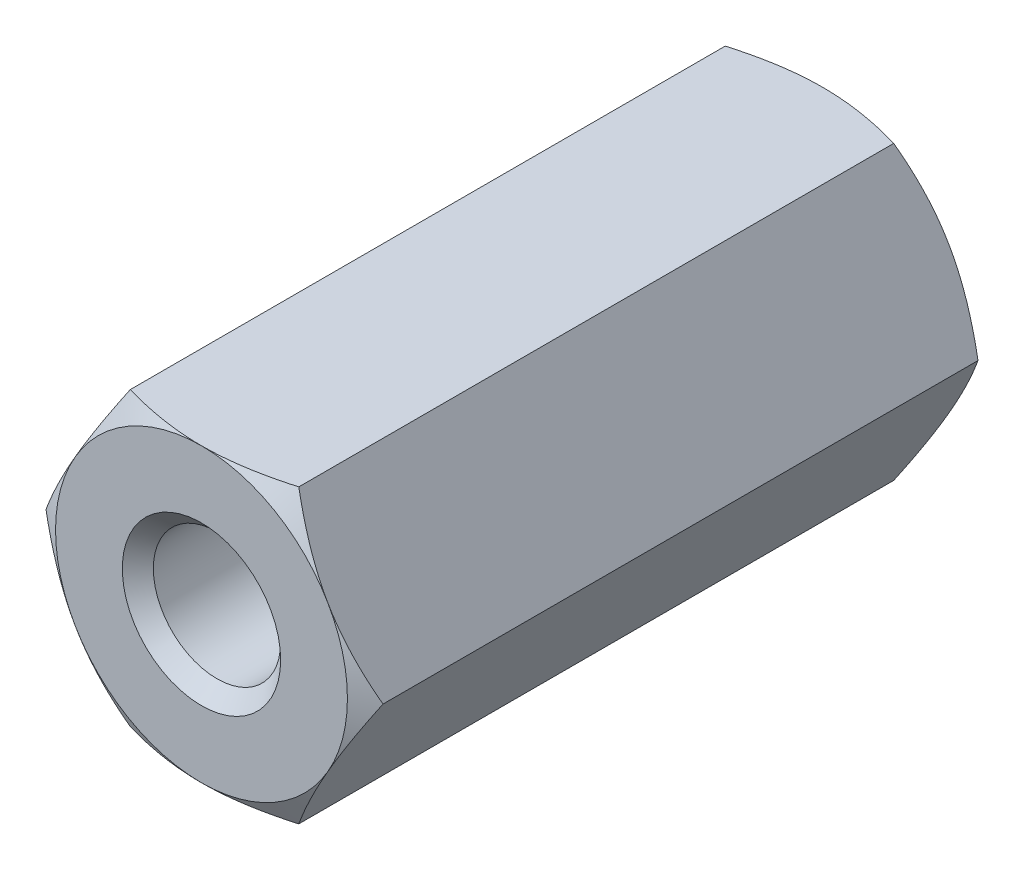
ISO-10303-21;
HEADER;
FILE_DESCRIPTION(('STEP AP214'),'2;1');
FILE_NAME('part.step','',(''),(''),'','','');
FILE_SCHEMA(('AUTOMOTIVE_DESIGN { 1 0 10303 214 1 1 1 1 }'));
ENDSEC;
DATA;
#1=APPLICATION_CONTEXT('core data for automotive mechanical design processes');
#2=APPLICATION_PROTOCOL_DEFINITION('international standard','automotive_design',2000,#1);
#3=PRODUCT_CONTEXT('',#1,'mechanical');
#4=PRODUCT('Part','Part','',(#3));
#5=PRODUCT_RELATED_PRODUCT_CATEGORY('part','',(#4));
#6=PRODUCT_DEFINITION_FORMATION('','',#4);
#7=PRODUCT_DEFINITION_CONTEXT('part definition',#1,'design');
#8=PRODUCT_DEFINITION('design','',#6,#7);
#9=PRODUCT_DEFINITION_SHAPE('','',#8);
#10=(LENGTH_UNIT() NAMED_UNIT(*) SI_UNIT(.MILLI.,.METRE.));
#11=(NAMED_UNIT(*) PLANE_ANGLE_UNIT() SI_UNIT($,.RADIAN.));
#12=(NAMED_UNIT(*) SI_UNIT($,.STERADIAN.) SOLID_ANGLE_UNIT());
#13=UNCERTAINTY_MEASURE_WITH_UNIT(LENGTH_MEASURE(1.E-05),#10,'distance_accuracy_value','');
#14=(GEOMETRIC_REPRESENTATION_CONTEXT(3) GLOBAL_UNCERTAINTY_ASSIGNED_CONTEXT((#13)) GLOBAL_UNIT_ASSIGNED_CONTEXT((#10,
#11,#12)) REPRESENTATION_CONTEXT('',''));
#15=CARTESIAN_POINT('',(0.,0.,0.));
#16=DIRECTION('',(0.,0.,1.));
#17=DIRECTION('',(1.,0.,0.));
#18=AXIS2_PLACEMENT_3D('',#15,#16,#17);
#19=CARTESIAN_POINT('',(0.,0.,-6.));
#20=DIRECTION('',(0.,0.,1.));
#21=DIRECTION('',(1.,0.,0.));
#22=AXIS2_PLACEMENT_3D('',#19,#20,#21);
#23=CONICAL_SURFACE('',#22,2.35,1.0471975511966);
#24=CARTESIAN_POINT('',(0.,-2.35,-6.));
#25=CARTESIAN_POINT('',(-0.0571314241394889,-2.34998207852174,-6.00002004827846));
#26=CARTESIAN_POINT('',(-0.114262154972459,-2.34994530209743,-5.99882905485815));
#27=CARTESIAN_POINT('',(-0.228234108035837,-2.34989200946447,-5.9940693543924));
#28=CARTESIAN_POINT('',(-0.285075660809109,-2.34987542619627,-5.9905085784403));
#29=CARTESIAN_POINT('',(-0.399044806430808,-2.34991978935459,-5.98101315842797));
#30=CARTESIAN_POINT('',(-0.456170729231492,-2.34998139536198,-5.97505861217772));
#31=CARTESIAN_POINT('',(-0.571263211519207,-2.35009640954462,-5.96081772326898));
#32=CARTESIAN_POINT('',(-0.629224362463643,-2.35014963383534,-5.95248805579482));
#33=CARTESIAN_POINT('',(-0.74206182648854,-2.35015725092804,-5.93420461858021));
#34=CARTESIAN_POINT('',(-0.796953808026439,-2.35011622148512,-5.92434687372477));
#35=CARTESIAN_POINT('',(-0.907157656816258,-2.35005079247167,-5.90270409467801));
#36=CARTESIAN_POINT('',(-0.962464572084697,-2.35002663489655,-5.89089390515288));
#37=CARTESIAN_POINT('',(-1.07381088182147,-2.34999732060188,-5.86536521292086));
#38=CARTESIAN_POINT('',(-1.12984248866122,-2.34999255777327,-5.8516129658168));
#39=CARTESIAN_POINT('',(-1.2429173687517,-2.34999209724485,-5.82220504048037));
#40=CARTESIAN_POINT('',(-1.29995044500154,-2.34999663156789,-5.80651005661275));
#41=CARTESIAN_POINT('',(-1.35677313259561,-2.34999999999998,-5.79010646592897));
#42=B_SPLINE_CURVE_WITH_KNOTS('',3,(#24,#25,#26,#27,#28,#29,#30,#31,#32,#33,#34,#35,#36,#37,#38,
#39,#40,#41),.UNSPECIFIED.,.F.,.F.,(4,2,2,2,2,2,2,2,4),(0.,0.171380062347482,0.342189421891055,
0.514449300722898,0.690078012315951,0.85735809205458,1.02699077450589,1.20005187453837,
1.37748447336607),.UNSPECIFIED.);
#43=CARTESIAN_POINT('',(0.,-2.35,-6.));
#44=VERTEX_POINT('',#43);
#45=CARTESIAN_POINT('',(-1.35677313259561,-2.35,-5.79010646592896));
#46=VERTEX_POINT('',#45);
#47=EDGE_CURVE('E797',#44,#46,#42,.T.);
#48=ORIENTED_EDGE('',*,*,#47,.T.);
#49=CARTESIAN_POINT('',(-1.35677313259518,-2.34999999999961,-5.79010646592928));
#50=CARTESIAN_POINT('',(-1.38524931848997,-2.30067108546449,-5.80654916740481));
#51=CARTESIAN_POINT('',(-1.41383092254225,-2.25115878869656,-5.82227951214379));
#52=CARTESIAN_POINT('',(-1.4705077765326,-2.15299689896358,-5.85174948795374));
#53=CARTESIAN_POINT('',(-1.49859769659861,-2.10435604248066,-5.86552856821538));
#54=CARTESIAN_POINT('',(-1.55443746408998,-2.00770249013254,-5.89110218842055));
#55=CARTESIAN_POINT('',(-1.58218307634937,-1.95969635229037,-5.90293053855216));
#56=CARTESIAN_POINT('',(-1.63748446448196,-1.86404217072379,-5.9246014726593));
#57=CARTESIAN_POINT('',(-1.66503759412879,-1.81639829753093,-5.93446915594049));
#58=CARTESIAN_POINT('',(-1.72144578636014,-1.71867419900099,-5.95271303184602));
#59=CARTESIAN_POINT('',(-1.75030427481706,-1.66857982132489,-5.96100341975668));
#60=CARTESIAN_POINT('',(-1.80760488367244,-1.56909917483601,-5.97517708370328));
#61=CARTESIAN_POINT('',(-1.83604445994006,-1.5197176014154,-5.98110321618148));
#62=CARTESIAN_POINT('',(-1.89285266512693,-1.42123457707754,-5.99055360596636));
#63=CARTESIAN_POINT('',(-1.92121990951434,-1.37213422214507,-5.9940974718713));
#64=CARTESIAN_POINT('',(-1.97811651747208,-1.2736927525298,-5.99883459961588));
#65=CARTESIAN_POINT('',(-2.00664610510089,-1.22435138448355,-6.00001988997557));
#66=CARTESIAN_POINT('',(-2.03515969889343,-1.17500000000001,-6.));
#67=B_SPLINE_CURVE_WITH_KNOTS('',3,(#49,#50,#51,#52,#53,#54,#55,#56,#57,#58,#59,#60,#61,#62,#63,
#64,#65,#66),.UNSPECIFIED.,.F.,.F.,(4,2,2,2,2,2,2,2,4),(0.,0.177855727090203,0.351336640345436,
0.521392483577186,0.689106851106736,0.864276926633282,1.03610921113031,1.20650922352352,
1.37748417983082),.UNSPECIFIED.);
#68=CARTESIAN_POINT('',(-2.03515969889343,-1.175,-6.));
#69=VERTEX_POINT('',#68);
#70=EDGE_CURVE('E386',#46,#69,#67,.T.);
#71=ORIENTED_EDGE('',*,*,#70,.T.);
#72=CARTESIAN_POINT('',(0.,0.,-6.));
#73=DIRECTION('',(0.,0.,1.));
#74=DIRECTION('',(1.,0.,0.));
#75=AXIS2_PLACEMENT_3D('',#72,#73,#74);
#76=CIRCLE('',#75,2.35);
#77=EDGE_CURVE('E413',#69,#44,#76,.T.);
#78=ORIENTED_EDGE('',*,*,#77,.T.);
#79=EDGE_LOOP('',(#48,#71,#78));
#80=FACE_BOUND('',#79,.T.);
#81=ADVANCED_FACE('F16',(#80),#23,.T.);
#82=CARTESIAN_POINT('',(0.,0.,-6.));
#83=DIRECTION('',(0.,0.,1.));
#84=DIRECTION('',(1.,0.,0.));
#85=AXIS2_PLACEMENT_3D('',#82,#83,#84);
#86=CONICAL_SURFACE('',#85,2.35,1.0471975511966);
#87=CARTESIAN_POINT('',(2.03515969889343,-1.17499999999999,-6.));
#88=CARTESIAN_POINT('',(2.00667423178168,-1.22430268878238,-6.0000198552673));
#89=CARTESIAN_POINT('',(1.97817723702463,-1.27359778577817,-5.99883401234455));
#90=CARTESIAN_POINT('',(1.92133687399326,-1.37197127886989,-5.99409676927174));
#91=CARTESIAN_POINT('',(1.8929933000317,-1.421049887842,-5.99055227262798));
#92=CARTESIAN_POINT('',(1.83621888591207,-1.51951127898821,-5.98110151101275));
#93=CARTESIAN_POINT('',(1.80778949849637,-1.56889290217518,-5.97517459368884));
#94=CARTESIAN_POINT('',(1.75048990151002,-1.66839238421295,-5.96100078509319));
#95=CARTESIAN_POINT('',(1.72162215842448,-1.71850537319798,-5.95271013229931));
#96=CARTESIAN_POINT('',(1.66518009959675,-1.81627678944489,-5.93446572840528));
#97=CARTESIAN_POINT('',(1.6376026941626,-1.8639494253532,-5.92459709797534));
#98=CARTESIAN_POINT('',(1.58225836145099,-1.95964970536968,-5.90292450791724));
#99=CARTESIAN_POINT('',(1.55449402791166,-2.00767324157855,-5.89109584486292));
#100=CARTESIAN_POINT('',(1.49862389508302,-2.10435071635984,-5.86552245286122));
#101=CARTESIAN_POINT('',(1.47052229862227,-2.15299817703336,-5.85174427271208));
#102=CARTESIAN_POINT('',(1.41383174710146,-2.25116352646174,-5.82227696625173));
#103=CARTESIAN_POINT('',(1.38524815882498,-2.30067279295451,-5.80654869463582));
#104=CARTESIAN_POINT('',(1.35677313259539,-2.34999999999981,-5.79010646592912));
#105=B_SPLINE_CURVE_WITH_KNOTS('',3,(#87,#88,#89,#90,#91,#92,#93,#94,#95,#96,#97,#98,#99,#100,
#101,#102,#103,#104),.UNSPECIFIED.,.F.,.F.,(4,2,2,2,2,2,2,2,4),(0.,0.170806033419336,
0.341114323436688,0.512931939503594,0.688163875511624,0.855988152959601,1.02611582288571,
1.19962971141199,1.37747903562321),.UNSPECIFIED.);
#106=CARTESIAN_POINT('',(2.03515969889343,-1.175,-6.));
#107=VERTEX_POINT('',#106);
#108=CARTESIAN_POINT('',(1.35677313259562,-2.35,-5.79010646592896));
#109=VERTEX_POINT('',#108);
#110=EDGE_CURVE('E474',#107,#109,#105,.T.);
#111=ORIENTED_EDGE('',*,*,#110,.T.);
#112=CARTESIAN_POINT('',(1.35677313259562,-2.34999999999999,-5.79010646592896));
#113=CARTESIAN_POINT('',(1.29993976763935,-2.34999669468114,-5.8065131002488));
#114=CARTESIAN_POINT('',(1.24289600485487,-2.34999167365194,-5.82221112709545));
#115=CARTESIAN_POINT('',(1.12980076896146,-2.34999037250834,-5.85162463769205));
#116=CARTESIAN_POINT('',(1.07375950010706,-2.34999387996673,-5.86537945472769));
#117=CARTESIAN_POINT('',(0.962394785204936,-2.35002021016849,-5.89091269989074));
#118=CARTESIAN_POINT('',(0.907079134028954,-2.35004264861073,-5.90272490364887));
#119=CARTESIAN_POINT('',(0.796858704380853,-2.35010348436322,-5.92437156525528));
#120=CARTESIAN_POINT('',(0.741958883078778,-2.35014165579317,-5.93423120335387));
#121=CARTESIAN_POINT('',(0.62913761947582,-2.35013023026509,-5.95251152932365));
#122=CARTESIAN_POINT('',(0.571200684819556,-2.35007621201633,-5.96083727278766));
#123=CARTESIAN_POINT('',(0.456146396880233,-2.34996316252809,-5.97507144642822));
#124=CARTESIAN_POINT('',(0.399034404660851,-2.34990424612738,-5.98102282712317));
#125=CARTESIAN_POINT('',(0.285083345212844,-2.34986570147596,-5.99051357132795));
#126=CARTESIAN_POINT('',(0.228245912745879,-2.3498854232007,-5.99407242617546));
#127=CARTESIAN_POINT('',(0.114272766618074,-2.34994357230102,-5.99882983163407));
#128=CARTESIAN_POINT('',(0.0571367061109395,-2.34998206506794,-6.00002005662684));
#129=CARTESIAN_POINT('',(0.,-2.35,-6.));
#130=B_SPLINE_CURVE_WITH_KNOTS('',3,(#112,#113,#114,#115,#116,#117,#118,#119,#120,#121,#122,
#123,#124,#125,#126,#127,#128,#129),.UNSPECIFIED.,.F.,.F.,(4,2,2,2,2,2,2,2,4),(0.,
0.177465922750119,0.350557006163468,0.520216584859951,0.687520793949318,0.863075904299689,
1.03529319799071,1.20608990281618,1.37748589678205),.UNSPECIFIED.);
#131=EDGE_CURVE('E802',#109,#44,#130,.T.);
#132=ORIENTED_EDGE('',*,*,#131,.T.);
#133=CARTESIAN_POINT('',(0.,0.,-6.));
#134=DIRECTION('',(0.,0.,1.));
#135=DIRECTION('',(1.,0.,0.));
#136=AXIS2_PLACEMENT_3D('',#133,#134,#135);
#137=CIRCLE('',#136,2.35);
#138=EDGE_CURVE('E801',#44,#107,#137,.T.);
#139=ORIENTED_EDGE('',*,*,#138,.T.);
#140=EDGE_LOOP('',(#111,#132,#139));
#141=FACE_BOUND('',#140,.T.);
#142=ADVANCED_FACE('F513',(#141),#86,.T.);
#143=CARTESIAN_POINT('',(0.,0.,-6.));
#144=DIRECTION('',(0.,0.,1.));
#145=DIRECTION('',(1.,0.,0.));
#146=AXIS2_PLACEMENT_3D('',#143,#144,#145);
#147=CONICAL_SURFACE('',#146,2.35,1.0471975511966);
#148=CARTESIAN_POINT('',(2.71354626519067,0.,-5.79010646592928));
#149=CARTESIAN_POINT('',(2.68506426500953,-0.049325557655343,-5.80654916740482));
#150=CARTESIAN_POINT('',(2.65647616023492,-0.0988341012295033,-5.82227951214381));
#151=CARTESIAN_POINT('',(2.59980389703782,-0.196998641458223,-5.85174948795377));
#152=CARTESIAN_POINT('',(2.57172463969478,-0.245645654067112,-5.86552856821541));
#153=CARTESIAN_POINT('',(2.51594009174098,-0.342331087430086,-5.89110218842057));
#154=CARTESIAN_POINT('',(2.48823836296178,-0.390362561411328,-5.90293053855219));
#155=CARTESIAN_POINT('',(2.43305010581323,-0.486082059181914,-5.92460147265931));
#156=CARTESIAN_POINT('',(2.40556586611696,-0.533765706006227,-5.9344691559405));
#157=CARTESIAN_POINT('',(2.3491384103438,-0.63147868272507,-5.95271303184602));
#158=CARTESIAN_POINT('',(2.32018465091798,-0.681518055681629,-5.96100341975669));
#159=CARTESIAN_POINT('',(2.2626821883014,-0.780882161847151,-5.97517708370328));
#160=CARTESIAN_POINT('',(2.23413627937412,-0.83020234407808,-5.98110321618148));
#161=CARTESIAN_POINT('',(2.17725158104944,-0.928641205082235,-5.99055360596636));
#162=CARTESIAN_POINT('',(2.14891304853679,-0.977758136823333,-5.99409747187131));
#163=CARTESIAN_POINT('',(2.09210853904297,-1.07625277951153,-5.99883459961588));
#164=CARTESIAN_POINT('',(2.06364245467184,-1.12563081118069,-6.00001988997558));
#165=CARTESIAN_POINT('',(2.03515969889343,-1.17499999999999,-6.));
#166=B_SPLINE_CURVE_WITH_KNOTS('',3,(#148,#149,#150,#151,#152,#153,#154,#155,#156,#157,#158,
#159,#160,#161,#162,#163,#164,#165),.UNSPECIFIED.,.F.,.F.,(4,2,2,2,2,2,2,2,4),(0.,
0.177855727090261,0.351336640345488,0.521392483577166,0.689106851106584,0.864276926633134,
1.03610921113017,1.20650922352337,1.37748417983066),.UNSPECIFIED.);
#167=CARTESIAN_POINT('',(2.71354626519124,0.,-5.79010646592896));
#168=VERTEX_POINT('',#167);
#169=EDGE_CURVE('E781',#168,#107,#166,.T.);
#170=ORIENTED_EDGE('',*,*,#169,.T.);
#171=CARTESIAN_POINT('',(0.,0.,-6.));
#172=DIRECTION('',(0.,0.,1.));
#173=DIRECTION('',(1.,0.,0.));
#174=AXIS2_PLACEMENT_3D('',#171,#172,#173);
#175=CIRCLE('',#174,2.35);
#176=CARTESIAN_POINT('',(2.03515969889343,1.175,-6.));
#177=VERTEX_POINT('',#176);
#178=EDGE_CURVE('E171',#107,#177,#175,.T.);
#179=ORIENTED_EDGE('',*,*,#178,.T.);
#180=CARTESIAN_POINT('',(2.03515969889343,1.175,-6.));
#181=CARTESIAN_POINT('',(2.06361434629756,1.1256795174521,-6.00001985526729));
#182=CARTESIAN_POINT('',(2.09205665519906,1.07635284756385,-5.99883401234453));
#183=CARTESIAN_POINT('',(2.14883041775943,0.977940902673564,-5.99409676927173));
#184=CARTESIAN_POINT('',(2.17716195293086,0.928855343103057,-5.99055227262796));
#185=CARTESIAN_POINT('',(2.23404481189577,0.830456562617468,-5.98110151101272));
#186=CARTESIAN_POINT('',(2.26259585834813,0.781145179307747,-5.97517459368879));
#187=CARTESIAN_POINT('',(2.32011513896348,0.681772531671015,-5.96100078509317));
#188=CARTESIAN_POINT('',(2.34908038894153,0.631715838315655,-5.95271013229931));
#189=CARTESIAN_POINT('',(2.40553188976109,0.533949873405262,-5.93446572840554));
#190=CARTESIAN_POINT('',(2.43302890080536,0.486230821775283,-5.92459709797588));
#191=CARTESIAN_POINT('',(2.4882356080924,0.390451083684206,-5.90292450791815));
#192=CARTESIAN_POINT('',(2.51594304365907,0.342394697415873,-5.89109584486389));
#193=CARTESIAN_POINT('',(2.5717331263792,0.245671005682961,-5.86552245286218));
#194=CARTESIAN_POINT('',(2.59981226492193,0.19701057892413,-5.85174427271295));
#195=CARTESIAN_POINT('',(2.65648067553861,0.0988324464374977,-5.82227696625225));
#196=CARTESIAN_POINT('',(2.68506516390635,0.049323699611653,-5.80654869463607));
#197=CARTESIAN_POINT('',(2.71354626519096,0.,-5.79010646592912));
#198=B_SPLINE_CURVE_WITH_KNOTS('',3,(#180,#181,#182,#183,#184,#185,#186,#187,#188,#189,#190,
#191,#192,#193,#194,#195,#196,#197),.UNSPECIFIED.,.F.,.F.,(4,2,2,2,2,2,2,2,4),(0.,
0.170806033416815,0.341114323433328,0.512931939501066,0.688163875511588,0.85598815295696,
1.02611582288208,1.19962971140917,1.37747903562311),.UNSPECIFIED.);
#199=EDGE_CURVE('E438',#177,#168,#198,.T.);
#200=ORIENTED_EDGE('',*,*,#199,.T.);
#201=EDGE_LOOP('',(#170,#179,#200));
#202=FACE_BOUND('',#201,.T.);
#203=ADVANCED_FACE('F512',(#202),#147,.T.);
#204=CARTESIAN_POINT('',(0.,0.,-6.));
#205=DIRECTION('',(0.,0.,1.));
#206=DIRECTION('',(1.,0.,0.));
#207=AXIS2_PLACEMENT_3D('',#204,#205,#206);
#208=CONICAL_SURFACE('',#207,2.35,1.0471975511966);
#209=CARTESIAN_POINT('',(1.35677313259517,2.34999999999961,-5.79010646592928));
#210=CARTESIAN_POINT('',(1.38524931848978,2.30067108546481,-5.80654916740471));
#211=CARTESIAN_POINT('',(1.4138309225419,2.25115878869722,-5.82227951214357));
#212=CARTESIAN_POINT('',(1.47050777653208,2.15299689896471,-5.85174948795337));
#213=CARTESIAN_POINT('',(1.49859769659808,2.10435604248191,-5.86552856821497));
#214=CARTESIAN_POINT('',(1.55443746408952,2.0077024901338,-5.89110218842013));
#215=CARTESIAN_POINT('',(1.582183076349,1.95969635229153,-5.90293053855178));
#216=CARTESIAN_POINT('',(1.63748446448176,1.86404217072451,-5.92460147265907));
#217=CARTESIAN_POINT('',(1.66503759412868,1.81639829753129,-5.93446915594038));
#218=CARTESIAN_POINT('',(1.72144578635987,1.71867419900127,-5.95271303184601));
#219=CARTESIAN_POINT('',(1.75030427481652,1.66857982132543,-5.96100341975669));
#220=CARTESIAN_POINT('',(1.8076048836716,1.56909917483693,-5.9751770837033));
#221=CARTESIAN_POINT('',(1.83604445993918,1.51971760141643,-5.98110321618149));
#222=CARTESIAN_POINT('',(1.89285266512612,1.42123457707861,-5.99055360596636));
#223=CARTESIAN_POINT('',(1.92121990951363,1.37213422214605,-5.99409747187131));
#224=CARTESIAN_POINT('',(1.97811651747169,1.27369275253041,-5.99883459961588));
#225=CARTESIAN_POINT('',(2.00664610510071,1.22435138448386,-6.00001988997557));
#226=CARTESIAN_POINT('',(2.03515969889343,1.175,-6.));
#227=B_SPLINE_CURVE_WITH_KNOTS('',3,(#209,#210,#211,#212,#213,#214,#215,#216,#217,#218,#219,
#220,#221,#222,#223,#224,#225,#226),.UNSPECIFIED.,.F.,.F.,(4,2,2,2,2,2,2,2,4),(0.,
0.177855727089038,0.351336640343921,0.521392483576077,0.689106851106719,0.864276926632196,
1.03610921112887,1.20650922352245,1.37748417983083),.UNSPECIFIED.);
#228=CARTESIAN_POINT('',(1.3567731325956,2.35,-5.79010646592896));
#229=VERTEX_POINT('',#228);
#230=EDGE_CURVE('E466',#229,#177,#227,.T.);
#231=ORIENTED_EDGE('',*,*,#230,.T.);
#232=CARTESIAN_POINT('',(0.,0.,-6.));
#233=DIRECTION('',(0.,0.,1.));
#234=DIRECTION('',(1.,0.,0.));
#235=AXIS2_PLACEMENT_3D('',#232,#233,#234);
#236=CIRCLE('',#235,2.35);
#237=CARTESIAN_POINT('',(0.,2.35,-6.));
#238=VERTEX_POINT('',#237);
#239=EDGE_CURVE('E165',#177,#238,#236,.T.);
#240=ORIENTED_EDGE('',*,*,#239,.T.);
#241=CARTESIAN_POINT('',(0.,2.35,-6.));
#242=CARTESIAN_POINT('',(0.0571314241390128,2.34998207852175,-6.00002004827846));
#243=CARTESIAN_POINT('',(0.114262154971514,2.34994530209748,-5.99882905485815));
#244=CARTESIAN_POINT('',(0.228234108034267,2.34989200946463,-5.99406935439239));
#245=CARTESIAN_POINT('',(0.285075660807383,2.3498754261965,-5.99050857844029));
#246=CARTESIAN_POINT('',(0.399044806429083,2.34991978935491,-5.98101315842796));
#247=CARTESIAN_POINT('',(0.456170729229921,2.34998139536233,-5.9750586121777));
#248=CARTESIAN_POINT('',(0.571263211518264,2.35009640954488,-5.96081772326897));
#249=CARTESIAN_POINT('',(0.629224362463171,2.35014963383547,-5.95248805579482));
#250=CARTESIAN_POINT('',(0.742061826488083,2.35015725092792,-5.93420461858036));
#251=CARTESIAN_POINT('',(0.79695380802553,2.35011622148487,-5.92434687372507));
#252=CARTESIAN_POINT('',(0.907157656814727,2.35005079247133,-5.90270409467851));
#253=CARTESIAN_POINT('',(0.962464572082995,2.35002663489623,-5.89089390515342));
#254=CARTESIAN_POINT('',(1.07381088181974,2.34999732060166,-5.86536521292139));
#255=CARTESIAN_POINT('',(1.12984248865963,2.34999255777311,-5.85161296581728));
#256=CARTESIAN_POINT('',(1.24291736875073,2.34999209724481,-5.82220504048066));
#257=CARTESIAN_POINT('',(1.29995044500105,2.34999663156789,-5.80651005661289));
#258=CARTESIAN_POINT('',(1.3567731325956,2.34999999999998,-5.79010646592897));
#259=B_SPLINE_CURVE_WITH_KNOTS('',3,(#241,#242,#243,#244,#245,#246,#247,#248,#249,#250,#251,
#252,#253,#254,#255,#256,#257,#258),.UNSPECIFIED.,.F.,.F.,(4,2,2,2,2,2,2,2,4),(0.,
0.171380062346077,0.342189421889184,0.514449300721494,0.690078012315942,0.857358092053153,
1.02699077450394,1.20005187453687,1.37748447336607),.UNSPECIFIED.);
#260=EDGE_CURVE('E482',#238,#229,#259,.T.);
#261=ORIENTED_EDGE('',*,*,#260,.T.);
#262=EDGE_LOOP('',(#231,#240,#261));
#263=FACE_BOUND('',#262,.T.);
#264=ADVANCED_FACE('F504',(#263),#208,.T.);
#265=CARTESIAN_POINT('',(0.,0.,-6.));
#266=DIRECTION('',(0.,0.,1.));
#267=DIRECTION('',(1.,0.,0.));
#268=AXIS2_PLACEMENT_3D('',#265,#266,#267);
#269=CONICAL_SURFACE('',#268,2.35,1.0471975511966);
#270=CARTESIAN_POINT('',(-2.03515969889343,-1.17500000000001,-6.));
#271=CARTESIAN_POINT('',(-2.06361434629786,-1.12567951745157,-6.0000198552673));
#272=CARTESIAN_POINT('',(-2.09205665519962,-1.07635284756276,-5.99883401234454));
#273=CARTESIAN_POINT('',(-2.14883041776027,-0.977940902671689,-5.99409676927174));
#274=CARTESIAN_POINT('',(-2.17716195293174,-0.928855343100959,-5.99055227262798));
#275=CARTESIAN_POINT('',(-2.23404481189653,-0.830456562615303,-5.98110151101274));
#276=CARTESIAN_POINT('',(-2.26259585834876,-0.781145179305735,-5.97517459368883));
#277=CARTESIAN_POINT('',(-2.3201151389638,-0.681772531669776,-5.96100078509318));
#278=CARTESIAN_POINT('',(-2.3490803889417,-0.631715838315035,-5.9527101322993));
#279=CARTESIAN_POINT('',(-2.40553188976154,-0.533949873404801,-5.93446572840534));
#280=CARTESIAN_POINT('',(-2.43302890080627,-0.486230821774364,-5.92459709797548));
#281=CARTESIAN_POINT('',(-2.48823560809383,-0.390451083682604,-5.90292450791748));
#282=CARTESIAN_POINT('',(-2.51594304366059,-0.34239469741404,-5.89109584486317));
#283=CARTESIAN_POINT('',(-2.57173312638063,-0.245671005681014,-5.86552245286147));
#284=CARTESIAN_POINT('',(-2.59981226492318,-0.197010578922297,-5.8517442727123));
#285=CARTESIAN_POINT('',(-2.65648067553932,-0.0988324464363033,-5.82227696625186));
#286=CARTESIAN_POINT('',(-2.68506516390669,-0.0493236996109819,-5.80654869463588));
#287=CARTESIAN_POINT('',(-2.71354626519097,1.17222805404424E-13,-5.79010646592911));
#288=B_SPLINE_CURVE_WITH_KNOTS('',3,(#270,#271,#272,#273,#274,#275,#276,#277,#278,#279,#280,
#281,#282,#283,#284,#285,#286,#287),.UNSPECIFIED.,.F.,.F.,(4,2,2,2,2,2,2,2,4),(0.,
0.170806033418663,0.341114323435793,0.512931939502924,0.688163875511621,0.85598815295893,
1.02611582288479,1.19962971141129,1.37747903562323),.UNSPECIFIED.);
#289=CARTESIAN_POINT('',(-2.71354626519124,0.,-5.79010646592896));
#290=VERTEX_POINT('',#289);
#291=EDGE_CURVE('E399',#69,#290,#288,.T.);
#292=ORIENTED_EDGE('',*,*,#291,.T.);
#293=CARTESIAN_POINT('',(-2.71354626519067,-1.81631235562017E-13,-5.79010646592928));
#294=CARTESIAN_POINT('',(-2.68506426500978,0.0493255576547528,-5.80654916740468));
#295=CARTESIAN_POINT('',(-2.65647616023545,0.0988341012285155,-5.82227951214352));
#296=CARTESIAN_POINT('',(-2.59980389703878,0.196998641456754,-5.85174948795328));
#297=CARTESIAN_POINT('',(-2.57172463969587,0.24564565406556,-5.86552856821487));
#298=CARTESIAN_POINT('',(-2.51594009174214,0.342331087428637,-5.89110218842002));
#299=CARTESIAN_POINT('',(-2.48823836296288,0.390362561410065,-5.90293053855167));
#300=CARTESIAN_POINT('',(-2.43305010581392,0.486082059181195,-5.92460147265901));
#301=CARTESIAN_POINT('',(-2.40556586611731,0.533765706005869,-5.93446915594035));
#302=CARTESIAN_POINT('',(-2.34913841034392,0.631478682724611,-5.95271303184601));
#303=CARTESIAN_POINT('',(-2.32018465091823,0.681518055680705,-5.9610034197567));
#304=CARTESIAN_POINT('',(-2.26268218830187,0.780882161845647,-5.9751770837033));
#305=CARTESIAN_POINT('',(-2.23413627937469,0.83020234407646,-5.98110321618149));
#306=CARTESIAN_POINT('',(-2.1772515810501,0.928641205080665,-5.99055360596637));
#307=CARTESIAN_POINT('',(-2.14891304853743,0.977758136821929,-5.99409747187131));
#308=CARTESIAN_POINT('',(-2.09210853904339,1.07625277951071,-5.99883459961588));
#309=CARTESIAN_POINT('',(-2.06364245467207,1.1256308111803,-6.00001988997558));
#310=CARTESIAN_POINT('',(-2.03515969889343,1.175,-6.));
#311=B_SPLINE_CURVE_WITH_KNOTS('',3,(#293,#294,#295,#296,#297,#298,#299,#300,#301,#302,#303,
#304,#305,#306,#307,#308,#309,#310),.UNSPECIFIED.,.F.,.F.,(4,2,2,2,2,2,2,2,4),(0.,
0.17785572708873,0.351336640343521,0.521392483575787,0.68910685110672,0.864276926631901,
1.03610921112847,1.20650922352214,1.37748417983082),.UNSPECIFIED.);
#312=CARTESIAN_POINT('',(-2.03515969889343,1.175,-6.));
#313=VERTEX_POINT('',#312);
#314=EDGE_CURVE('E527',#290,#313,#311,.T.);
#315=ORIENTED_EDGE('',*,*,#314,.T.);
#316=CARTESIAN_POINT('',(0.,0.,-6.));
#317=DIRECTION('',(0.,0.,1.));
#318=DIRECTION('',(1.,0.,0.));
#319=AXIS2_PLACEMENT_3D('',#316,#317,#318);
#320=CIRCLE('',#319,2.35);
#321=EDGE_CURVE('E407',#313,#69,#320,.T.);
#322=ORIENTED_EDGE('',*,*,#321,.T.);
#323=EDGE_LOOP('',(#292,#315,#322));
#324=FACE_BOUND('',#323,.T.);
#325=ADVANCED_FACE('F197',(#324),#269,.T.);
#326=CARTESIAN_POINT('',(0.,0.,-6.));
#327=DIRECTION('',(0.,0.,1.));
#328=DIRECTION('',(1.,0.,0.));
#329=AXIS2_PLACEMENT_3D('',#326,#327,#328);
#330=CONICAL_SURFACE('',#329,2.35,1.0471975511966);
#331=CARTESIAN_POINT('',(-1.35677313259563,2.34999999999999,-5.79010646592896));
#332=CARTESIAN_POINT('',(-1.29993976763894,2.34999669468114,-5.80651310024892));
#333=CARTESIAN_POINT('',(-1.24289600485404,2.3499916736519,-5.8222111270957));
#334=CARTESIAN_POINT('',(-1.12980076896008,2.34999037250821,-5.85162463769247));
#335=CARTESIAN_POINT('',(-1.07375950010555,2.34999387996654,-5.86537945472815));
#336=CARTESIAN_POINT('',(-0.962394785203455,2.35002021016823,-5.8909126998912));
#337=CARTESIAN_POINT('',(-0.907079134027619,2.35004264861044,-5.90272490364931));
#338=CARTESIAN_POINT('',(-0.796858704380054,2.35010348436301,-5.92437156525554));
#339=CARTESIAN_POINT('',(-0.741958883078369,2.35014165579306,-5.934231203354));
#340=CARTESIAN_POINT('',(-0.629137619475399,2.35013023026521,-5.95251152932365));
#341=CARTESIAN_POINT('',(-0.571200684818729,2.35007621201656,-5.96083727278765));
#342=CARTESIAN_POINT('',(-0.456146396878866,2.34996316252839,-5.97507144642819));
#343=CARTESIAN_POINT('',(-0.399034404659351,2.34990424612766,-5.98102282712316));
#344=CARTESIAN_POINT('',(-0.285083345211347,2.34986570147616,-5.99051357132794));
#345=CARTESIAN_POINT('',(-0.228245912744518,2.34988542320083,-5.99407242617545));
#346=CARTESIAN_POINT('',(-0.114272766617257,2.34994357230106,-5.99882983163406));
#347=CARTESIAN_POINT('',(-0.0571367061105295,2.34998206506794,-6.00002005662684));
#348=CARTESIAN_POINT('',(0.,2.35,-6.));
#349=B_SPLINE_CURVE_WITH_KNOTS('',3,(#331,#332,#333,#334,#335,#336,#337,#338,#339,#340,#341,
#342,#343,#344,#345,#346,#347,#348),.UNSPECIFIED.,.F.,.F.,(4,2,2,2,2,2,2,2,4),(0.,
0.177465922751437,0.350557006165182,0.520216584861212,0.687520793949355,0.863075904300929,
1.03529319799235,1.20608990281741,1.37748589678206),.UNSPECIFIED.);
#350=CARTESIAN_POINT('',(-1.35677313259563,2.35,-5.79010646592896));
#351=VERTEX_POINT('',#350);
#352=EDGE_CURVE('E218',#351,#238,#349,.T.);
#353=ORIENTED_EDGE('',*,*,#352,.T.);
#354=CARTESIAN_POINT('',(0.,0.,-6.));
#355=DIRECTION('',(0.,0.,1.));
#356=DIRECTION('',(1.,0.,0.));
#357=AXIS2_PLACEMENT_3D('',#354,#355,#356);
#358=CIRCLE('',#357,2.35);
#359=EDGE_CURVE('E402',#238,#313,#358,.T.);
#360=ORIENTED_EDGE('',*,*,#359,.T.);
#361=CARTESIAN_POINT('',(-2.03515969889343,1.175,-6.));
#362=CARTESIAN_POINT('',(-2.00667423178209,1.22430268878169,-6.00001985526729));
#363=CARTESIAN_POINT('',(-1.9781772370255,1.27359778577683,-5.99883401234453));
#364=CARTESIAN_POINT('',(-1.92133687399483,1.37197127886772,-5.99409676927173));
#365=CARTESIAN_POINT('',(-1.8929933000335,1.42104988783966,-5.99055227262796));
#366=CARTESIAN_POINT('',(-1.83621888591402,1.51951127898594,-5.98110151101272));
#367=CARTESIAN_POINT('',(-1.80778949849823,1.56889290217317,-5.97517459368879));
#368=CARTESIAN_POINT('',(-1.75048990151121,1.66839238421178,-5.96100078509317));
#369=CARTESIAN_POINT('',(-1.72162215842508,1.7185053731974,-5.95271013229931));
#370=CARTESIAN_POINT('',(-1.66518009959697,1.81627678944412,-5.93446572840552));
#371=CARTESIAN_POINT('',(-1.63760269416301,1.86394942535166,-5.92459709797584));
#372=CARTESIAN_POINT('',(-1.58225836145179,1.95964970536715,-5.90292450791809));
#373=CARTESIAN_POINT('',(-1.55449402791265,2.00767324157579,-5.89109584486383));
#374=CARTESIAN_POINT('',(-1.49862389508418,2.10435071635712,-5.86552245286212));
#375=CARTESIAN_POINT('',(-1.47052229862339,2.1529981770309,-5.85174427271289));
#376=CARTESIAN_POINT('',(-1.41383174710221,2.25116352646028,-5.82227696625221));
#377=CARTESIAN_POINT('',(-1.38524815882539,2.3006727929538,-5.80654869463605));
#378=CARTESIAN_POINT('',(-1.35677313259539,2.3499999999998,-5.79010646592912));
#379=B_SPLINE_CURVE_WITH_KNOTS('',3,(#361,#362,#363,#364,#365,#366,#367,#368,#369,#370,#371,
#372,#373,#374,#375,#376,#377,#378),.UNSPECIFIED.,.F.,.F.,(4,2,2,2,2,2,2,2,4),(0.,
0.170806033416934,0.341114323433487,0.512931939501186,0.688163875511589,0.855988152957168,
1.02611582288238,1.19962971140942,1.37747903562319),.UNSPECIFIED.);
#380=EDGE_CURVE('E154',#313,#351,#379,.T.);
#381=ORIENTED_EDGE('',*,*,#380,.T.);
#382=EDGE_LOOP('',(#353,#360,#381));
#383=FACE_BOUND('',#382,.T.);
#384=ADVANCED_FACE('F186',(#383),#330,.T.);
#385=CARTESIAN_POINT('',(0.,0.,4.));
#386=DIRECTION('',(0.,0.,-1.));
#387=DIRECTION('',(-1.,0.,0.));
#388=AXIS2_PLACEMENT_3D('',#385,#386,#387);
#389=CONICAL_SURFACE('',#388,2.35,1.0471975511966);
#390=CARTESIAN_POINT('',(0.,0.,4.));
#391=DIRECTION('',(0.,0.,1.));
#392=DIRECTION('',(1.,0.,0.));
#393=AXIS2_PLACEMENT_3D('',#390,#391,#392);
#394=CIRCLE('',#393,2.35);
#395=CARTESIAN_POINT('',(-2.03515969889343,-1.175,4.));
#396=VERTEX_POINT('',#395);
#397=CARTESIAN_POINT('',(0.,-2.35,4.));
#398=VERTEX_POINT('',#397);
#399=EDGE_CURVE('E299',#396,#398,#394,.T.);
#400=ORIENTED_EDGE('',*,*,#399,.F.);
#401=CARTESIAN_POINT('',(-1.35677313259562,-2.35,3.79010646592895));
#402=CARTESIAN_POINT('',(-1.72031939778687,-1.72031939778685,3.99999999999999));
#403=CARTESIAN_POINT('',(-2.03515969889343,-1.175,3.99999999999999));
#404=B_SPLINE_CURVE_WITH_KNOTS('',2,(#401,#402,#403),.UNSPECIFIED.,.F.,.F.,(3,3),(0.,1.),.UNSPECIFIED.);
#405=CARTESIAN_POINT('',(-1.35677313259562,-2.35,3.79010646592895));
#406=VERTEX_POINT('',#405);
#407=EDGE_CURVE('E360',#406,#396,#404,.T.);
#408=ORIENTED_EDGE('',*,*,#407,.F.);
#409=CARTESIAN_POINT('',(0.,-2.35,4.));
#410=CARTESIAN_POINT('',(-0.629680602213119,-2.35,4.));
#411=CARTESIAN_POINT('',(-1.35677313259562,-2.35,3.79010646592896));
#412=B_SPLINE_CURVE_WITH_KNOTS('',2,(#409,#410,#411),.UNSPECIFIED.,.F.,.F.,(3,3),(0.,1.),.UNSPECIFIED.);
#413=EDGE_CURVE('E960',#398,#406,#412,.T.);
#414=ORIENTED_EDGE('',*,*,#413,.F.);
#415=EDGE_LOOP('',(#400,#408,#414));
#416=FACE_BOUND('',#415,.T.);
#417=ADVANCED_FACE('F196',(#416),#389,.T.);
#418=CARTESIAN_POINT('',(0.,0.,4.));
#419=DIRECTION('',(0.,0.,-1.));
#420=DIRECTION('',(-1.,0.,0.));
#421=AXIS2_PLACEMENT_3D('',#418,#419,#420);
#422=CONICAL_SURFACE('',#421,2.35,1.0471975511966);
#423=CARTESIAN_POINT('',(0.,0.,4.));
#424=DIRECTION('',(0.,0.,1.));
#425=DIRECTION('',(1.,0.,0.));
#426=AXIS2_PLACEMENT_3D('',#423,#424,#425);
#427=CIRCLE('',#426,2.35);
#428=CARTESIAN_POINT('',(2.03515969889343,-1.175,4.));
#429=VERTEX_POINT('',#428);
#430=EDGE_CURVE('E179',#398,#429,#427,.T.);
#431=ORIENTED_EDGE('',*,*,#430,.F.);
#432=CARTESIAN_POINT('',(1.35677313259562,-2.35,3.79010646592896));
#433=CARTESIAN_POINT('',(0.629680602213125,-2.35,4.));
#434=CARTESIAN_POINT('',(0.,-2.35,4.));
#435=B_SPLINE_CURVE_WITH_KNOTS('',2,(#432,#433,#434),.UNSPECIFIED.,.F.,.F.,(3,3),(0.,1.),.UNSPECIFIED.);
#436=CARTESIAN_POINT('',(1.35677313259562,-2.35,3.79010646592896));
#437=VERTEX_POINT('',#436);
#438=EDGE_CURVE('E953',#437,#398,#435,.T.);
#439=ORIENTED_EDGE('',*,*,#438,.F.);
#440=CARTESIAN_POINT('',(2.03515969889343,-1.175,4.));
#441=CARTESIAN_POINT('',(1.72031939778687,-1.72031939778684,4.));
#442=CARTESIAN_POINT('',(1.35677313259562,-2.35,3.79010646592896));
#443=B_SPLINE_CURVE_WITH_KNOTS('',2,(#440,#441,#442),.UNSPECIFIED.,.F.,.F.,(3,3),(0.,1.),.UNSPECIFIED.);
#444=EDGE_CURVE('E790',#429,#437,#443,.T.);
#445=ORIENTED_EDGE('',*,*,#444,.F.);
#446=EDGE_LOOP('',(#431,#439,#445));
#447=FACE_BOUND('',#446,.T.);
#448=ADVANCED_FACE('F634',(#447),#422,.T.);
#449=CARTESIAN_POINT('',(0.,0.,4.));
#450=DIRECTION('',(0.,0.,-1.));
#451=DIRECTION('',(-1.,0.,0.));
#452=AXIS2_PLACEMENT_3D('',#449,#450,#451);
#453=CONICAL_SURFACE('',#452,2.35,1.0471975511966);
#454=CARTESIAN_POINT('',(2.71354626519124,0.,3.79010646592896));
#455=CARTESIAN_POINT('',(2.34999999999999,-0.629680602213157,4.));
#456=CARTESIAN_POINT('',(2.03515969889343,-1.175,4.));
#457=B_SPLINE_CURVE_WITH_KNOTS('',2,(#454,#455,#456),.UNSPECIFIED.,.F.,.F.,(3,3),(0.,1.),.UNSPECIFIED.);
#458=CARTESIAN_POINT('',(2.71354626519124,0.,3.79010646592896));
#459=VERTEX_POINT('',#458);
#460=EDGE_CURVE('E819',#459,#429,#457,.T.);
#461=ORIENTED_EDGE('',*,*,#460,.F.);
#462=CARTESIAN_POINT('',(2.03515969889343,1.175,4.));
#463=CARTESIAN_POINT('',(2.34999999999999,0.629680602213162,4.));
#464=CARTESIAN_POINT('',(2.71354626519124,0.,3.79010646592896));
#465=B_SPLINE_CURVE_WITH_KNOTS('',2,(#462,#463,#464),.UNSPECIFIED.,.F.,.F.,(3,3),(0.,1.),.UNSPECIFIED.);
#466=CARTESIAN_POINT('',(2.03515969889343,1.175,4.));
#467=VERTEX_POINT('',#466);
#468=EDGE_CURVE('E442',#467,#459,#465,.T.);
#469=ORIENTED_EDGE('',*,*,#468,.F.);
#470=CARTESIAN_POINT('',(0.,0.,4.));
#471=DIRECTION('',(0.,0.,1.));
#472=DIRECTION('',(1.,0.,0.));
#473=AXIS2_PLACEMENT_3D('',#470,#471,#472);
#474=CIRCLE('',#473,2.35);
#475=EDGE_CURVE('E177',#429,#467,#474,.T.);
#476=ORIENTED_EDGE('',*,*,#475,.F.);
#477=EDGE_LOOP('',(#461,#469,#476));
#478=FACE_BOUND('',#477,.T.);
#479=ADVANCED_FACE('F639',(#478),#453,.T.);
#480=CARTESIAN_POINT('',(0.,0.,4.));
#481=DIRECTION('',(0.,0.,-1.));
#482=DIRECTION('',(-1.,0.,0.));
#483=AXIS2_PLACEMENT_3D('',#480,#481,#482);
#484=CONICAL_SURFACE('',#483,2.35,1.0471975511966);
#485=CARTESIAN_POINT('',(0.,2.35,4.));
#486=CARTESIAN_POINT('',(0.629680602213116,2.35,4.));
#487=CARTESIAN_POINT('',(1.35677313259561,2.35,3.79010646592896));
#488=B_SPLINE_CURVE_WITH_KNOTS('',2,(#485,#486,#487),.UNSPECIFIED.,.F.,.F.,(3,3),(0.,1.),.UNSPECIFIED.);
#489=CARTESIAN_POINT('',(0.,2.35,4.));
#490=VERTEX_POINT('',#489);
#491=CARTESIAN_POINT('',(1.35677313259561,2.35,3.79010646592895));
#492=VERTEX_POINT('',#491);
#493=EDGE_CURVE('E436',#490,#492,#488,.T.);
#494=ORIENTED_EDGE('',*,*,#493,.F.);
#495=CARTESIAN_POINT('',(0.,0.,4.));
#496=DIRECTION('',(0.,0.,1.));
#497=DIRECTION('',(1.,0.,0.));
#498=AXIS2_PLACEMENT_3D('',#495,#496,#497);
#499=CIRCLE('',#498,2.35);
#500=EDGE_CURVE('E306',#467,#490,#499,.T.);
#501=ORIENTED_EDGE('',*,*,#500,.F.);
#502=CARTESIAN_POINT('',(1.35677313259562,2.35,3.79010646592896));
#503=CARTESIAN_POINT('',(1.72031939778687,1.72031939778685,4.));
#504=CARTESIAN_POINT('',(2.03515969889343,1.17500000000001,4.));
#505=B_SPLINE_CURVE_WITH_KNOTS('',2,(#502,#503,#504),.UNSPECIFIED.,.F.,.F.,(3,3),(0.,1.),.UNSPECIFIED.);
#506=EDGE_CURVE('E449',#492,#467,#505,.T.);
#507=ORIENTED_EDGE('',*,*,#506,.F.);
#508=EDGE_LOOP('',(#494,#501,#507));
#509=FACE_BOUND('',#508,.T.);
#510=ADVANCED_FACE('F281',(#509),#484,.T.);
#511=CARTESIAN_POINT('',(0.,0.,4.));
#512=DIRECTION('',(0.,0.,-1.));
#513=DIRECTION('',(-1.,0.,0.));
#514=AXIS2_PLACEMENT_3D('',#511,#512,#513);
#515=CONICAL_SURFACE('',#514,2.35,1.0471975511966);
#516=CARTESIAN_POINT('',(0.,0.,4.));
#517=DIRECTION('',(0.,0.,1.));
#518=DIRECTION('',(1.,0.,0.));
#519=AXIS2_PLACEMENT_3D('',#516,#517,#518);
#520=CIRCLE('',#519,2.35);
#521=CARTESIAN_POINT('',(-2.03515969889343,1.175,4.));
#522=VERTEX_POINT('',#521);
#523=EDGE_CURVE('E290',#522,#396,#520,.T.);
#524=ORIENTED_EDGE('',*,*,#523,.F.);
#525=CARTESIAN_POINT('',(-2.71354626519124,0.,3.79010646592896));
#526=CARTESIAN_POINT('',(-2.34999999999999,0.629680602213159,4.));
#527=CARTESIAN_POINT('',(-2.03515969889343,1.175,4.));
#528=B_SPLINE_CURVE_WITH_KNOTS('',2,(#525,#526,#527),.UNSPECIFIED.,.F.,.F.,(3,3),(0.,1.),.UNSPECIFIED.);
#529=CARTESIAN_POINT('',(-2.71354626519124,0.,3.79010646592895));
#530=VERTEX_POINT('',#529);
#531=EDGE_CURVE('E311',#530,#522,#528,.T.);
#532=ORIENTED_EDGE('',*,*,#531,.F.);
#533=CARTESIAN_POINT('',(-2.03515969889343,-1.175,3.99999999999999));
#534=CARTESIAN_POINT('',(-2.34999999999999,-0.629680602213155,3.99999999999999));
#535=CARTESIAN_POINT('',(-2.71354626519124,0.,3.79010646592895));
#536=B_SPLINE_CURVE_WITH_KNOTS('',2,(#533,#534,#535),.UNSPECIFIED.,.F.,.F.,(3,3),(0.,1.),.UNSPECIFIED.);
#537=EDGE_CURVE('E938',#396,#530,#536,.T.);
#538=ORIENTED_EDGE('',*,*,#537,.F.);
#539=EDGE_LOOP('',(#524,#532,#538));
#540=FACE_BOUND('',#539,.T.);
#541=ADVANCED_FACE('F279',(#540),#515,.T.);
#542=CARTESIAN_POINT('',(0.,0.,4.));
#543=DIRECTION('',(0.,0.,-1.));
#544=DIRECTION('',(-1.,0.,0.));
#545=AXIS2_PLACEMENT_3D('',#542,#543,#544);
#546=CONICAL_SURFACE('',#545,2.35,1.0471975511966);
#547=CARTESIAN_POINT('',(-2.03515969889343,1.175,4.));
#548=CARTESIAN_POINT('',(-1.72031939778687,1.72031939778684,4.));
#549=CARTESIAN_POINT('',(-1.35677313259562,2.35,3.79010646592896));
#550=B_SPLINE_CURVE_WITH_KNOTS('',2,(#547,#548,#549),.UNSPECIFIED.,.F.,.F.,(3,3),(0.,1.),.UNSPECIFIED.);
#551=CARTESIAN_POINT('',(-1.35677313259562,2.35,3.79010646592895));
#552=VERTEX_POINT('',#551);
#553=EDGE_CURVE('E139',#522,#552,#550,.T.);
#554=ORIENTED_EDGE('',*,*,#553,.F.);
#555=CARTESIAN_POINT('',(0.,0.,4.));
#556=DIRECTION('',(0.,0.,1.));
#557=DIRECTION('',(1.,0.,0.));
#558=AXIS2_PLACEMENT_3D('',#555,#556,#557);
#559=CIRCLE('',#558,2.35);
#560=EDGE_CURVE('E300',#490,#522,#559,.T.);
#561=ORIENTED_EDGE('',*,*,#560,.F.);
#562=CARTESIAN_POINT('',(-1.35677313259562,2.35,3.79010646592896));
#563=CARTESIAN_POINT('',(-0.629680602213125,2.35,4.));
#564=CARTESIAN_POINT('',(0.,2.35,4.));
#565=B_SPLINE_CURVE_WITH_KNOTS('',2,(#562,#563,#564),.UNSPECIFIED.,.F.,.F.,(3,3),(0.,1.),.UNSPECIFIED.);
#566=EDGE_CURVE('E265',#552,#490,#565,.T.);
#567=ORIENTED_EDGE('',*,*,#566,.F.);
#568=EDGE_LOOP('',(#554,#561,#567));
#569=FACE_BOUND('',#568,.T.);
#570=ADVANCED_FACE('F269',(#569),#546,.T.);
#571=CARTESIAN_POINT('',(0.,0.,-6.));
#572=DIRECTION('',(0.,0.,-1.));
#573=DIRECTION('',(-1.,0.,0.));
#574=AXIS2_PLACEMENT_3D('',#571,#572,#573);
#575=CONICAL_SURFACE('',#574,1.275,0.785398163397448);
#576=CARTESIAN_POINT('',(0.,0.,-6.));
#577=DIRECTION('',(0.,0.,1.));
#578=DIRECTION('',(1.,0.,0.));
#579=AXIS2_PLACEMENT_3D('',#576,#577,#578);
#580=CIRCLE('',#579,1.275);
#581=CARTESIAN_POINT('',(1.275,0.,-6.));
#582=VERTEX_POINT('',#581);
#583=EDGE_CURVE('E161',#582,#582,#580,.T.);
#584=ORIENTED_EDGE('',*,*,#583,.F.);
#585=EDGE_LOOP('',(#584));
#586=FACE_BOUND('',#585,.T.);
#587=CARTESIAN_POINT('',(0.,0.,-5.75));
#588=DIRECTION('',(0.,0.,-1.));
#589=DIRECTION('',(-1.,0.,0.));
#590=AXIS2_PLACEMENT_3D('',#587,#588,#589);
#591=CIRCLE('',#590,1.025);
#592=CARTESIAN_POINT('',(-1.025,0.,-5.75));
#593=VERTEX_POINT('',#592);
#594=EDGE_CURVE('E28',#593,#593,#591,.T.);
#595=ORIENTED_EDGE('',*,*,#594,.F.);
#596=EDGE_LOOP('',(#595));
#597=FACE_BOUND('',#596,.T.);
#598=ADVANCED_FACE('F278',(#586,#597),#575,.F.);
#599=CARTESIAN_POINT('',(0.,0.,4.));
#600=DIRECTION('',(0.,0.,1.));
#601=DIRECTION('',(1.,0.,0.));
#602=AXIS2_PLACEMENT_3D('',#599,#600,#601);
#603=CONICAL_SURFACE('',#602,1.275,0.785398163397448);
#604=CARTESIAN_POINT('',(0.,0.,4.));
#605=DIRECTION('',(0.,0.,-1.));
#606=DIRECTION('',(1.,0.,0.));
#607=AXIS2_PLACEMENT_3D('',#604,#605,#606);
#608=CIRCLE('',#607,1.275);
#609=CARTESIAN_POINT('',(1.275,0.,4.));
#610=VERTEX_POINT('',#609);
#611=EDGE_CURVE('E174',#610,#610,#608,.T.);
#612=ORIENTED_EDGE('',*,*,#611,.F.);
#613=EDGE_LOOP('',(#612));
#614=FACE_BOUND('',#613,.T.);
#615=CARTESIAN_POINT('',(0.,0.,3.75));
#616=DIRECTION('',(0.,0.,1.));
#617=DIRECTION('',(1.,0.,0.));
#618=AXIS2_PLACEMENT_3D('',#615,#616,#617);
#619=CIRCLE('',#618,1.025);
#620=CARTESIAN_POINT('',(1.025,0.,3.75));
#621=VERTEX_POINT('',#620);
#622=EDGE_CURVE('E10',#621,#621,#619,.T.);
#623=ORIENTED_EDGE('',*,*,#622,.F.);
#624=EDGE_LOOP('',(#623));
#625=FACE_BOUND('',#624,.T.);
#626=ADVANCED_FACE('F660',(#614,#625),#603,.F.);
#627=CARTESIAN_POINT('',(0.,0.,4.));
#628=DIRECTION('',(0.,0.,-1.));
#629=DIRECTION('',(0.,-1.,0.));
#630=AXIS2_PLACEMENT_3D('',#627,#628,#629);
#631=CYLINDRICAL_SURFACE('',#630,1.025);
#632=ORIENTED_EDGE('',*,*,#622,.T.);
#633=EDGE_LOOP('',(#632));
#634=FACE_BOUND('',#633,.T.);
#635=ORIENTED_EDGE('',*,*,#594,.T.);
#636=EDGE_LOOP('',(#635));
#637=FACE_BOUND('',#636,.T.);
#638=ADVANCED_FACE('F651',(#634,#637),#631,.F.);
#639=CARTESIAN_POINT('',(0.,0.,4.));
#640=DIRECTION('',(0.,0.,1.));
#641=DIRECTION('',(1.,0.,0.));
#642=AXIS2_PLACEMENT_3D('',#639,#640,#641);
#643=PLANE('',#642);
#644=ORIENTED_EDGE('',*,*,#475,.T.);
#645=ORIENTED_EDGE('',*,*,#500,.T.);
#646=ORIENTED_EDGE('',*,*,#560,.T.);
#647=ORIENTED_EDGE('',*,*,#523,.T.);
#648=ORIENTED_EDGE('',*,*,#399,.T.);
#649=ORIENTED_EDGE('',*,*,#430,.T.);
#650=EDGE_LOOP('',(#644,#645,#646,#647,#648,#649));
#651=FACE_BOUND('',#650,.T.);
#652=ORIENTED_EDGE('',*,*,#611,.T.);
#653=EDGE_LOOP('',(#652));
#654=FACE_BOUND('',#653,.T.);
#655=ADVANCED_FACE('F627',(#651,#654),#643,.T.);
#656=CARTESIAN_POINT('',(-1.35677313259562,2.35,-6.));
#657=DIRECTION('',(-0.866025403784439,0.5,0.));
#658=DIRECTION('',(0.,0.,1.));
#659=AXIS2_PLACEMENT_3D('',#656,#657,#658);
#660=PLANE('',#659);
#661=ORIENTED_EDGE('',*,*,#314,.F.);
#662=DIRECTION('',(0.,0.,1.));
#663=VECTOR('',#662,1.);
#664=CARTESIAN_POINT('',(-2.71354626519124,0.,-6.));
#665=LINE('',#664,#663);
#666=EDGE_CURVE('E327',#290,#530,#665,.T.);
#667=ORIENTED_EDGE('',*,*,#666,.T.);
#668=ORIENTED_EDGE('',*,*,#531,.T.);
#669=ORIENTED_EDGE('',*,*,#553,.T.);
#670=DIRECTION('',(0.,0.,1.));
#671=VECTOR('',#670,1.);
#672=CARTESIAN_POINT('',(-1.35677313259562,2.35,-6.));
#673=LINE('',#672,#671);
#674=EDGE_CURVE('E422',#351,#552,#673,.T.);
#675=ORIENTED_EDGE('',*,*,#674,.F.);
#676=ORIENTED_EDGE('',*,*,#380,.F.);
#677=EDGE_LOOP('',(#661,#667,#668,#669,#675,#676));
#678=FACE_BOUND('',#677,.T.);
#679=ADVANCED_FACE('F235',(#678),#660,.T.);
#680=CARTESIAN_POINT('',(1.35677313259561,2.35,-6.));
#681=DIRECTION('',(0.,1.,0.));
#682=DIRECTION('',(1.,0.,0.));
#683=AXIS2_PLACEMENT_3D('',#680,#681,#682);
#684=PLANE('',#683);
#685=ORIENTED_EDGE('',*,*,#352,.F.);
#686=ORIENTED_EDGE('',*,*,#674,.T.);
#687=ORIENTED_EDGE('',*,*,#566,.T.);
#688=ORIENTED_EDGE('',*,*,#493,.T.);
#689=DIRECTION('',(0.,0.,1.));
#690=VECTOR('',#689,1.);
#691=CARTESIAN_POINT('',(1.35677313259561,2.35,-6.));
#692=LINE('',#691,#690);
#693=EDGE_CURVE('E458',#229,#492,#692,.T.);
#694=ORIENTED_EDGE('',*,*,#693,.F.);
#695=ORIENTED_EDGE('',*,*,#260,.F.);
#696=EDGE_LOOP('',(#685,#686,#687,#688,#694,#695));
#697=FACE_BOUND('',#696,.T.);
#698=ADVANCED_FACE('F224',(#697),#684,.T.);
#699=CARTESIAN_POINT('',(2.71354626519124,0.,-6.));
#700=DIRECTION('',(0.866025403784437,0.5,0.));
#701=DIRECTION('',(0.,0.,-1.));
#702=AXIS2_PLACEMENT_3D('',#699,#700,#701);
#703=PLANE('',#702);
#704=ORIENTED_EDGE('',*,*,#230,.F.);
#705=ORIENTED_EDGE('',*,*,#693,.T.);
#706=ORIENTED_EDGE('',*,*,#506,.T.);
#707=ORIENTED_EDGE('',*,*,#468,.T.);
#708=DIRECTION('',(0.,0.,1.));
#709=VECTOR('',#708,1.);
#710=CARTESIAN_POINT('',(2.71354626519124,0.,-6.));
#711=LINE('',#710,#709);
#712=EDGE_CURVE('E796',#168,#459,#711,.T.);
#713=ORIENTED_EDGE('',*,*,#712,.F.);
#714=ORIENTED_EDGE('',*,*,#199,.F.);
#715=EDGE_LOOP('',(#704,#705,#706,#707,#713,#714));
#716=FACE_BOUND('',#715,.T.);
#717=ADVANCED_FACE('F234',(#716),#703,.T.);
#718=CARTESIAN_POINT('',(1.35677313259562,-2.35,-6.));
#719=DIRECTION('',(0.86602540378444,-0.5,0.));
#720=DIRECTION('',(0.,0.,-1.));
#721=AXIS2_PLACEMENT_3D('',#718,#719,#720);
#722=PLANE('',#721);
#723=ORIENTED_EDGE('',*,*,#169,.F.);
#724=ORIENTED_EDGE('',*,*,#712,.T.);
#725=ORIENTED_EDGE('',*,*,#460,.T.);
#726=ORIENTED_EDGE('',*,*,#444,.T.);
#727=DIRECTION('',(0.,0.,1.));
#728=VECTOR('',#727,1.);
#729=CARTESIAN_POINT('',(1.35677313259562,-2.35,-6.));
#730=LINE('',#729,#728);
#731=EDGE_CURVE('E784',#109,#437,#730,.T.);
#732=ORIENTED_EDGE('',*,*,#731,.F.);
#733=ORIENTED_EDGE('',*,*,#110,.F.);
#734=EDGE_LOOP('',(#723,#724,#725,#726,#732,#733));
#735=FACE_BOUND('',#734,.T.);
#736=ADVANCED_FACE('F589',(#735),#722,.T.);
#737=CARTESIAN_POINT('',(-1.35677313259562,-2.35,-6.));
#738=DIRECTION('',(0.,-1.,0.));
#739=DIRECTION('',(0.,0.,-1.));
#740=AXIS2_PLACEMENT_3D('',#737,#738,#739);
#741=PLANE('',#740);
#742=ORIENTED_EDGE('',*,*,#131,.F.);
#743=ORIENTED_EDGE('',*,*,#731,.T.);
#744=ORIENTED_EDGE('',*,*,#438,.T.);
#745=ORIENTED_EDGE('',*,*,#413,.T.);
#746=DIRECTION('',(0.,0.,1.));
#747=VECTOR('',#746,1.);
#748=CARTESIAN_POINT('',(-1.35677313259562,-2.35,-6.));
#749=LINE('',#748,#747);
#750=EDGE_CURVE('E396',#46,#406,#749,.T.);
#751=ORIENTED_EDGE('',*,*,#750,.F.);
#752=ORIENTED_EDGE('',*,*,#47,.F.);
#753=EDGE_LOOP('',(#742,#743,#744,#745,#751,#752));
#754=FACE_BOUND('',#753,.T.);
#755=ADVANCED_FACE('F340',(#754),#741,.T.);
#756=CARTESIAN_POINT('',(-2.71354626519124,0.,-6.));
#757=DIRECTION('',(-0.866025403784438,-0.5,0.));
#758=DIRECTION('',(-0.5,0.866025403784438,0.));
#759=AXIS2_PLACEMENT_3D('',#756,#757,#758);
#760=PLANE('',#759);
#761=ORIENTED_EDGE('',*,*,#70,.F.);
#762=ORIENTED_EDGE('',*,*,#750,.T.);
#763=ORIENTED_EDGE('',*,*,#407,.T.);
#764=ORIENTED_EDGE('',*,*,#537,.T.);
#765=ORIENTED_EDGE('',*,*,#666,.F.);
#766=ORIENTED_EDGE('',*,*,#291,.F.);
#767=EDGE_LOOP('',(#761,#762,#763,#764,#765,#766));
#768=FACE_BOUND('',#767,.T.);
#769=ADVANCED_FACE('F337',(#768),#760,.T.);
#770=CARTESIAN_POINT('',(0.,0.,-6.));
#771=DIRECTION('',(0.,0.,1.));
#772=DIRECTION('',(1.,0.,0.));
#773=AXIS2_PLACEMENT_3D('',#770,#771,#772);
#774=PLANE('',#773);
#775=ORIENTED_EDGE('',*,*,#239,.F.);
#776=ORIENTED_EDGE('',*,*,#178,.F.);
#777=ORIENTED_EDGE('',*,*,#138,.F.);
#778=ORIENTED_EDGE('',*,*,#77,.F.);
#779=ORIENTED_EDGE('',*,*,#321,.F.);
#780=ORIENTED_EDGE('',*,*,#359,.F.);
#781=EDGE_LOOP('',(#775,#776,#777,#778,#779,#780));
#782=FACE_BOUND('',#781,.T.);
#783=ORIENTED_EDGE('',*,*,#583,.T.);
#784=EDGE_LOOP('',(#783));
#785=FACE_BOUND('',#784,.T.);
#786=ADVANCED_FACE('F162',(#782,#785),#774,.F.);
#787=CLOSED_SHELL('',(#81,#142,#203,#264,#325,#384,#417,#448,#479,#510,#541,#570,#598,#626,#638,
#655,#679,#698,#717,#736,#755,#769,#786));
#788=MANIFOLD_SOLID_BREP('B1',#787);
#789=ADVANCED_BREP_SHAPE_REPRESENTATION('',(#18,#788),#14);
#790=SHAPE_DEFINITION_REPRESENTATION(#9,#789);
ENDSEC;
END-ISO-10303-21;
